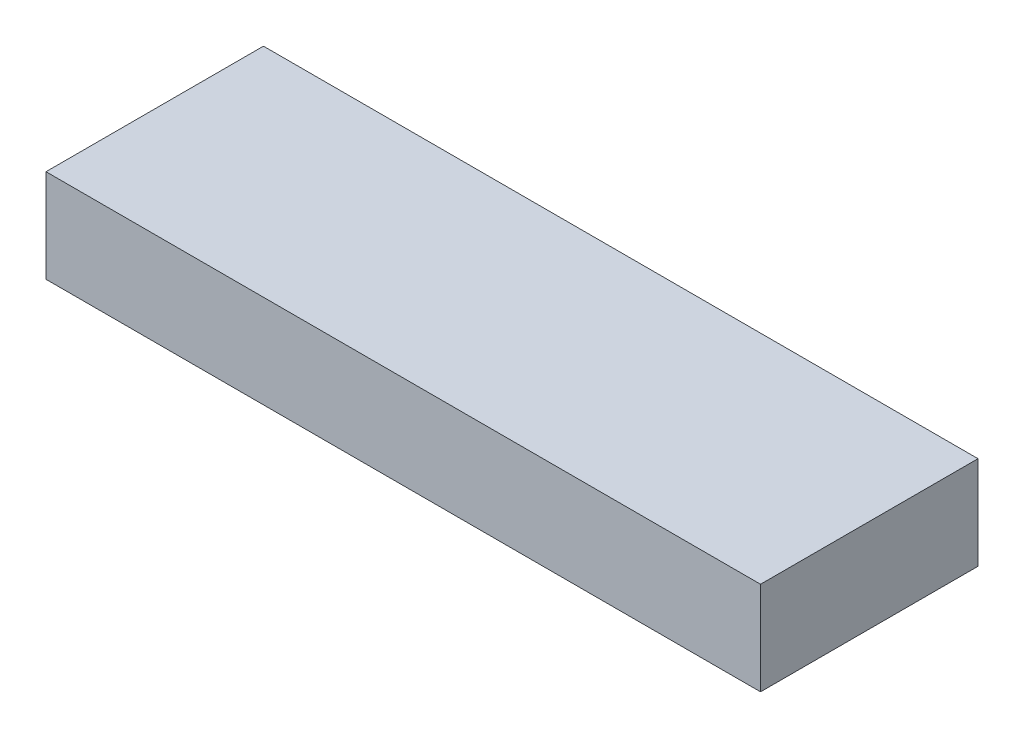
ISO-10303-21;
HEADER;
FILE_DESCRIPTION(('STEP AP214'),'2;1');
FILE_NAME('part.step','',(''),(''),'','','');
FILE_SCHEMA(('AUTOMOTIVE_DESIGN { 1 0 10303 214 1 1 1 1 }'));
ENDSEC;
DATA;
#1=APPLICATION_CONTEXT('core data for automotive mechanical design processes');
#2=APPLICATION_PROTOCOL_DEFINITION('international standard','automotive_design',2000,#1);
#3=PRODUCT_CONTEXT('',#1,'mechanical');
#4=PRODUCT('Part','Part','',(#3));
#5=PRODUCT_RELATED_PRODUCT_CATEGORY('part','',(#4));
#6=PRODUCT_DEFINITION_FORMATION('','',#4);
#7=PRODUCT_DEFINITION_CONTEXT('part definition',#1,'design');
#8=PRODUCT_DEFINITION('design','',#6,#7);
#9=PRODUCT_DEFINITION_SHAPE('','',#8);
#10=(LENGTH_UNIT() NAMED_UNIT(*) SI_UNIT(.MILLI.,.METRE.));
#11=(NAMED_UNIT(*) PLANE_ANGLE_UNIT() SI_UNIT($,.RADIAN.));
#12=(NAMED_UNIT(*) SI_UNIT($,.STERADIAN.) SOLID_ANGLE_UNIT());
#13=UNCERTAINTY_MEASURE_WITH_UNIT(LENGTH_MEASURE(1.E-05),#10,'distance_accuracy_value','');
#14=(GEOMETRIC_REPRESENTATION_CONTEXT(3) GLOBAL_UNCERTAINTY_ASSIGNED_CONTEXT((#13)) GLOBAL_UNIT_ASSIGNED_CONTEXT((#10,
#11,#12)) REPRESENTATION_CONTEXT('',''));
#15=CARTESIAN_POINT('',(0.,0.,0.));
#16=DIRECTION('',(0.,0.,1.));
#17=DIRECTION('',(1.,0.,0.));
#18=AXIS2_PLACEMENT_3D('',#15,#16,#17);
#19=CARTESIAN_POINT('',(292.1,0.,0.));
#20=DIRECTION('',(0.,0.,-1.));
#21=DIRECTION('',(-1.,0.,0.));
#22=AXIS2_PLACEMENT_3D('',#19,#20,#21);
#23=PLANE('',#22);
#24=DIRECTION('',(0.,-1.,0.));
#25=VECTOR('',#24,1.);
#26=CARTESIAN_POINT('',(0.,0.,0.));
#27=LINE('',#26,#25);
#28=CARTESIAN_POINT('',(0.,38.1,0.));
#29=VERTEX_POINT('',#28);
#30=CARTESIAN_POINT('',(0.,0.,0.));
#31=VERTEX_POINT('',#30);
#32=EDGE_CURVE('E105',#29,#31,#27,.T.);
#33=ORIENTED_EDGE('',*,*,#32,.T.);
#34=DIRECTION('',(-1.,0.,0.));
#35=VECTOR('',#34,1.);
#36=CARTESIAN_POINT('',(292.1,0.,0.));
#37=LINE('',#36,#35);
#38=CARTESIAN_POINT('',(292.1,0.,0.));
#39=VERTEX_POINT('',#38);
#40=EDGE_CURVE('E11',#39,#31,#37,.T.);
#41=ORIENTED_EDGE('',*,*,#40,.F.);
#42=DIRECTION('',(0.,-1.,0.));
#43=VECTOR('',#42,1.);
#44=CARTESIAN_POINT('',(292.1,0.,0.));
#45=LINE('',#44,#43);
#46=CARTESIAN_POINT('',(292.1,38.1,0.));
#47=VERTEX_POINT('',#46);
#48=EDGE_CURVE('E88',#47,#39,#45,.T.);
#49=ORIENTED_EDGE('',*,*,#48,.F.);
#50=DIRECTION('',(-1.,0.,0.));
#51=VECTOR('',#50,1.);
#52=CARTESIAN_POINT('',(292.1,38.1,0.));
#53=LINE('',#52,#51);
#54=EDGE_CURVE('E101',#47,#29,#53,.T.);
#55=ORIENTED_EDGE('',*,*,#54,.T.);
#56=EDGE_LOOP('',(#33,#41,#49,#55));
#57=FACE_BOUND('',#56,.T.);
#58=ADVANCED_FACE('F36',(#57),#23,.F.);
#59=CARTESIAN_POINT('',(292.1,0.,0.));
#60=DIRECTION('',(0.,1.,0.));
#61=DIRECTION('',(0.,0.,1.));
#62=AXIS2_PLACEMENT_3D('',#59,#60,#61);
#63=PLANE('',#62);
#64=DIRECTION('',(0.,0.,-1.));
#65=VECTOR('',#64,1.);
#66=CARTESIAN_POINT('',(0.,0.,0.));
#67=LINE('',#66,#65);
#68=CARTESIAN_POINT('',(0.,0.,-88.9));
#69=VERTEX_POINT('',#68);
#70=EDGE_CURVE('E93',#31,#69,#67,.T.);
#71=ORIENTED_EDGE('',*,*,#70,.T.);
#72=DIRECTION('',(-1.,0.,0.));
#73=VECTOR('',#72,1.);
#74=CARTESIAN_POINT('',(292.1,0.,-88.9));
#75=LINE('',#74,#73);
#76=CARTESIAN_POINT('',(292.1,0.,-88.9));
#77=VERTEX_POINT('',#76);
#78=EDGE_CURVE('E45',#77,#69,#75,.T.);
#79=ORIENTED_EDGE('',*,*,#78,.F.);
#80=DIRECTION('',(0.,0.,-1.));
#81=VECTOR('',#80,1.);
#82=CARTESIAN_POINT('',(292.1,0.,0.));
#83=LINE('',#82,#81);
#84=EDGE_CURVE('E83',#39,#77,#83,.T.);
#85=ORIENTED_EDGE('',*,*,#84,.F.);
#86=ORIENTED_EDGE('',*,*,#40,.T.);
#87=EDGE_LOOP('',(#71,#79,#85,#86));
#88=FACE_BOUND('',#87,.T.);
#89=ADVANCED_FACE('F92',(#88),#63,.F.);
#90=CARTESIAN_POINT('',(292.1,0.,-88.9));
#91=DIRECTION('',(0.,0.,1.));
#92=DIRECTION('',(1.,0.,0.));
#93=AXIS2_PLACEMENT_3D('',#90,#91,#92);
#94=PLANE('',#93);
#95=DIRECTION('',(0.,1.,0.));
#96=VECTOR('',#95,1.);
#97=CARTESIAN_POINT('',(0.,0.,-88.9));
#98=LINE('',#97,#96);
#99=CARTESIAN_POINT('',(0.,38.1,-88.9));
#100=VERTEX_POINT('',#99);
#101=EDGE_CURVE('E70',#69,#100,#98,.T.);
#102=ORIENTED_EDGE('',*,*,#101,.T.);
#103=DIRECTION('',(-1.,0.,0.));
#104=VECTOR('',#103,1.);
#105=CARTESIAN_POINT('',(292.1,38.1,-88.9));
#106=LINE('',#105,#104);
#107=CARTESIAN_POINT('',(292.1,38.1,-88.9));
#108=VERTEX_POINT('',#107);
#109=EDGE_CURVE('E95',#108,#100,#106,.T.);
#110=ORIENTED_EDGE('',*,*,#109,.F.);
#111=DIRECTION('',(0.,1.,0.));
#112=VECTOR('',#111,1.);
#113=CARTESIAN_POINT('',(292.1,0.,-88.9));
#114=LINE('',#113,#112);
#115=EDGE_CURVE('E86',#77,#108,#114,.T.);
#116=ORIENTED_EDGE('',*,*,#115,.F.);
#117=ORIENTED_EDGE('',*,*,#78,.T.);
#118=EDGE_LOOP('',(#102,#110,#116,#117));
#119=FACE_BOUND('',#118,.T.);
#120=ADVANCED_FACE('F96',(#119),#94,.F.);
#121=CARTESIAN_POINT('',(292.1,38.1,0.));
#122=DIRECTION('',(0.,-1.,0.));
#123=DIRECTION('',(0.,0.,-1.));
#124=AXIS2_PLACEMENT_3D('',#121,#122,#123);
#125=PLANE('',#124);
#126=DIRECTION('',(0.,0.,1.));
#127=VECTOR('',#126,1.);
#128=CARTESIAN_POINT('',(0.,38.1,0.));
#129=LINE('',#128,#127);
#130=EDGE_CURVE('E76',#100,#29,#129,.T.);
#131=ORIENTED_EDGE('',*,*,#130,.T.);
#132=ORIENTED_EDGE('',*,*,#54,.F.);
#133=DIRECTION('',(0.,0.,1.));
#134=VECTOR('',#133,1.);
#135=CARTESIAN_POINT('',(292.1,38.1,0.));
#136=LINE('',#135,#134);
#137=EDGE_CURVE('E53',#108,#47,#136,.T.);
#138=ORIENTED_EDGE('',*,*,#137,.F.);
#139=ORIENTED_EDGE('',*,*,#109,.T.);
#140=EDGE_LOOP('',(#131,#132,#138,#139));
#141=FACE_BOUND('',#140,.T.);
#142=ADVANCED_FACE('F119',(#141),#125,.F.);
#143=CARTESIAN_POINT('',(292.1,0.,0.));
#144=DIRECTION('',(-1.,0.,0.));
#145=DIRECTION('',(0.,0.,1.));
#146=AXIS2_PLACEMENT_3D('',#143,#144,#145);
#147=PLANE('',#146);
#148=ORIENTED_EDGE('',*,*,#48,.T.);
#149=ORIENTED_EDGE('',*,*,#84,.T.);
#150=ORIENTED_EDGE('',*,*,#115,.T.);
#151=ORIENTED_EDGE('',*,*,#137,.T.);
#152=EDGE_LOOP('',(#148,#149,#150,#151));
#153=FACE_BOUND('',#152,.T.);
#154=ADVANCED_FACE('F84',(#153),#147,.F.);
#155=CARTESIAN_POINT('',(0.,0.,0.));
#156=DIRECTION('',(-1.,0.,0.));
#157=DIRECTION('',(0.,0.,1.));
#158=AXIS2_PLACEMENT_3D('',#155,#156,#157);
#159=PLANE('',#158);
#160=ORIENTED_EDGE('',*,*,#32,.F.);
#161=ORIENTED_EDGE('',*,*,#130,.F.);
#162=ORIENTED_EDGE('',*,*,#101,.F.);
#163=ORIENTED_EDGE('',*,*,#70,.F.);
#164=EDGE_LOOP('',(#160,#161,#162,#163));
#165=FACE_BOUND('',#164,.T.);
#166=ADVANCED_FACE('F122',(#165),#159,.T.);
#167=CLOSED_SHELL('',(#58,#89,#120,#142,#154,#166));
#168=MANIFOLD_SOLID_BREP('B2',#167);
#169=ADVANCED_BREP_SHAPE_REPRESENTATION('',(#18,#168),#14);
#170=SHAPE_DEFINITION_REPRESENTATION(#9,#169);
ENDSEC;
END-ISO-10303-21;
